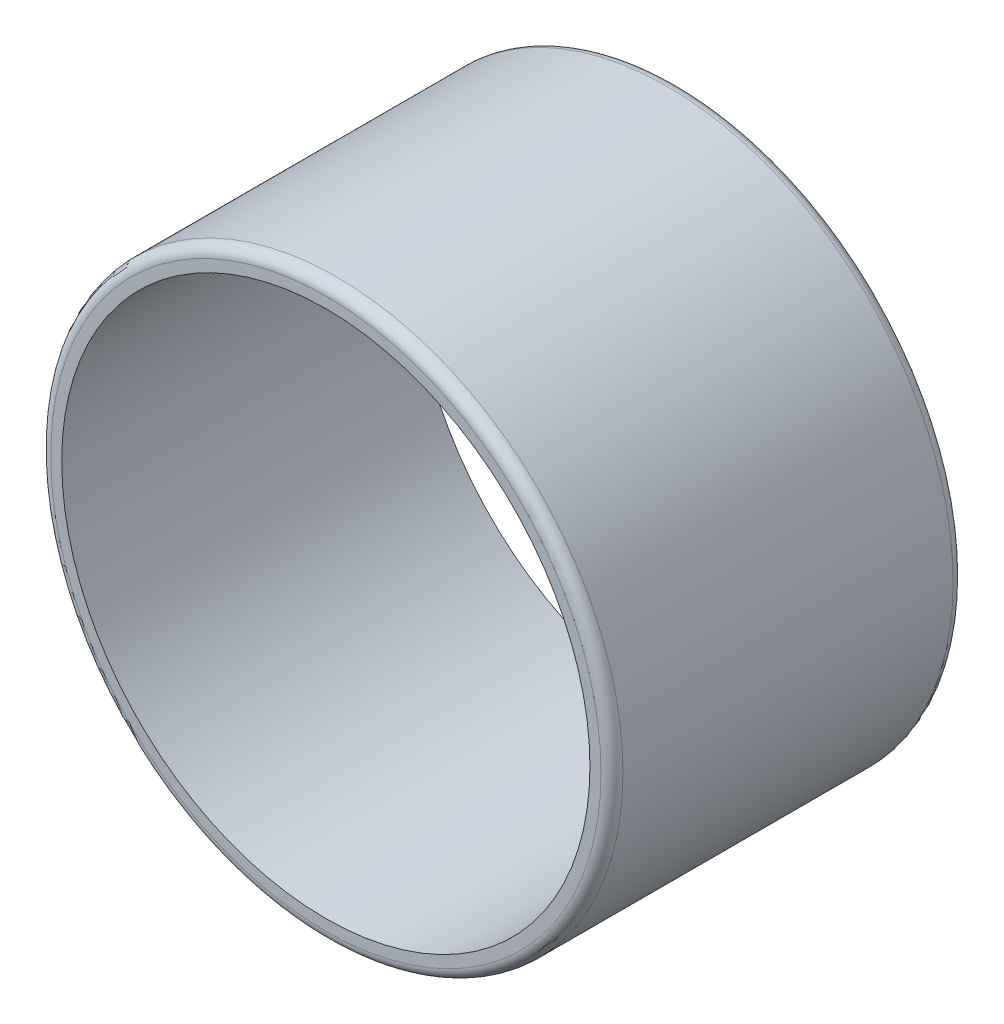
ISO-10303-21;
HEADER;
FILE_DESCRIPTION(('STEP AP214'),'2;1');
FILE_NAME('part.step','',(''),(''),'','','');
FILE_SCHEMA(('AUTOMOTIVE_DESIGN { 1 0 10303 214 1 1 1 1 }'));
ENDSEC;
DATA;
#1=APPLICATION_CONTEXT('core data for automotive mechanical design processes');
#2=APPLICATION_PROTOCOL_DEFINITION('international standard','automotive_design',2000,#1);
#3=PRODUCT_CONTEXT('',#1,'mechanical');
#4=PRODUCT('Part','Part','',(#3));
#5=PRODUCT_RELATED_PRODUCT_CATEGORY('part','',(#4));
#6=PRODUCT_DEFINITION_FORMATION('','',#4);
#7=PRODUCT_DEFINITION_CONTEXT('part definition',#1,'design');
#8=PRODUCT_DEFINITION('design','',#6,#7);
#9=PRODUCT_DEFINITION_SHAPE('','',#8);
#10=(LENGTH_UNIT() NAMED_UNIT(*) SI_UNIT(.MILLI.,.METRE.));
#11=(NAMED_UNIT(*) PLANE_ANGLE_UNIT() SI_UNIT($,.RADIAN.));
#12=(NAMED_UNIT(*) SI_UNIT($,.STERADIAN.) SOLID_ANGLE_UNIT());
#13=UNCERTAINTY_MEASURE_WITH_UNIT(LENGTH_MEASURE(1.E-05),#10,'distance_accuracy_value','');
#14=(GEOMETRIC_REPRESENTATION_CONTEXT(3) GLOBAL_UNCERTAINTY_ASSIGNED_CONTEXT((#13)) GLOBAL_UNIT_ASSIGNED_CONTEXT((#10,
#11,#12)) REPRESENTATION_CONTEXT('',''));
#15=CARTESIAN_POINT('',(0.,0.,0.));
#16=DIRECTION('',(0.,0.,1.));
#17=DIRECTION('',(1.,0.,0.));
#18=AXIS2_PLACEMENT_3D('',#15,#16,#17);
#19=CARTESIAN_POINT('',(0.,0.,8.));
#20=DIRECTION('',(0.,0.,1.));
#21=DIRECTION('',(1.,0.,0.));
#22=AXIS2_PLACEMENT_3D('',#19,#20,#21);
#23=PLANE('',#22);
#24=CARTESIAN_POINT('',(0.,0.,8.));
#25=DIRECTION('',(0.,0.,1.));
#26=DIRECTION('',(1.,0.,0.));
#27=AXIS2_PLACEMENT_3D('',#24,#25,#26);
#28=CIRCLE('',#27,12.5);
#29=CARTESIAN_POINT('',(12.5,0.,8.));
#30=VERTEX_POINT('',#29);
#31=EDGE_CURVE('E10',#30,#30,#28,.T.);
#32=ORIENTED_EDGE('',*,*,#31,.T.);
#33=EDGE_LOOP('',(#32));
#34=FACE_BOUND('',#33,.T.);
#35=CARTESIAN_POINT('',(0.,0.,8.));
#36=DIRECTION('',(0.,0.,1.));
#37=DIRECTION('',(1.,0.,0.));
#38=AXIS2_PLACEMENT_3D('',#35,#36,#37);
#39=CIRCLE('',#38,12.);
#40=CARTESIAN_POINT('',(12.,0.,8.));
#41=VERTEX_POINT('',#40);
#42=EDGE_CURVE('E49',#41,#41,#39,.T.);
#43=ORIENTED_EDGE('',*,*,#42,.F.);
#44=EDGE_LOOP('',(#43));
#45=FACE_BOUND('',#44,.T.);
#46=ADVANCED_FACE('F29',(#34,#45),#23,.T.);
#47=CARTESIAN_POINT('',(0.,0.,-8.));
#48=DIRECTION('',(0.,0.,1.));
#49=DIRECTION('',(1.,0.,0.));
#50=AXIS2_PLACEMENT_3D('',#47,#48,#49);
#51=PLANE('',#50);
#52=CARTESIAN_POINT('',(0.,0.,-8.));
#53=DIRECTION('',(0.,0.,1.));
#54=DIRECTION('',(1.,0.,0.));
#55=AXIS2_PLACEMENT_3D('',#52,#53,#54);
#56=CIRCLE('',#55,12.5);
#57=CARTESIAN_POINT('',(12.5,0.,-8.));
#58=VERTEX_POINT('',#57);
#59=EDGE_CURVE('E36',#58,#58,#56,.F.);
#60=ORIENTED_EDGE('',*,*,#59,.T.);
#61=EDGE_LOOP('',(#60));
#62=FACE_BOUND('',#61,.T.);
#63=CARTESIAN_POINT('',(0.,0.,-8.));
#64=DIRECTION('',(0.,0.,1.));
#65=DIRECTION('',(1.,0.,0.));
#66=AXIS2_PLACEMENT_3D('',#63,#64,#65);
#67=CIRCLE('',#66,12.);
#68=CARTESIAN_POINT('',(12.,0.,-8.));
#69=VERTEX_POINT('',#68);
#70=EDGE_CURVE('E52',#69,#69,#67,.T.);
#71=ORIENTED_EDGE('',*,*,#70,.T.);
#72=EDGE_LOOP('',(#71));
#73=FACE_BOUND('',#72,.T.);
#74=ADVANCED_FACE('F56',(#62,#73),#51,.F.);
#75=CARTESIAN_POINT('',(0.,0.,8.));
#76=DIRECTION('',(0.,0.,-1.));
#77=DIRECTION('',(-1.,0.,0.));
#78=AXIS2_PLACEMENT_3D('',#75,#76,#77);
#79=CYLINDRICAL_SURFACE('',#78,13.);
#80=CARTESIAN_POINT('',(0.,0.,-7.5));
#81=DIRECTION('',(0.,0.,1.));
#82=DIRECTION('',(1.,0.,0.));
#83=AXIS2_PLACEMENT_3D('',#80,#81,#82);
#84=CIRCLE('',#83,13.);
#85=CARTESIAN_POINT('',(13.,0.,-7.5));
#86=VERTEX_POINT('',#85);
#87=EDGE_CURVE('E40',#86,#86,#84,.T.);
#88=ORIENTED_EDGE('',*,*,#87,.T.);
#89=EDGE_LOOP('',(#88));
#90=FACE_BOUND('',#89,.T.);
#91=CARTESIAN_POINT('',(0.,0.,7.5));
#92=DIRECTION('',(0.,0.,1.));
#93=DIRECTION('',(1.,0.,0.));
#94=AXIS2_PLACEMENT_3D('',#91,#92,#93);
#95=CIRCLE('',#94,13.);
#96=CARTESIAN_POINT('',(13.,0.,7.5));
#97=VERTEX_POINT('',#96);
#98=EDGE_CURVE('E44',#97,#97,#95,.F.);
#99=ORIENTED_EDGE('',*,*,#98,.T.);
#100=EDGE_LOOP('',(#99));
#101=FACE_BOUND('',#100,.T.);
#102=ADVANCED_FACE('F31',(#90,#101),#79,.T.);
#103=CARTESIAN_POINT('',(0.,0.,8.));
#104=DIRECTION('',(0.,0.,-1.));
#105=DIRECTION('',(-1.,0.,0.));
#106=AXIS2_PLACEMENT_3D('',#103,#104,#105);
#107=CYLINDRICAL_SURFACE('',#106,12.);
#108=ORIENTED_EDGE('',*,*,#42,.T.);
#109=EDGE_LOOP('',(#108));
#110=FACE_BOUND('',#109,.T.);
#111=ORIENTED_EDGE('',*,*,#70,.F.);
#112=EDGE_LOOP('',(#111));
#113=FACE_BOUND('',#112,.T.);
#114=ADVANCED_FACE('F58',(#110,#113),#107,.F.);
#115=CARTESIAN_POINT('',(0.,0.,-7.5));
#116=DIRECTION('',(0.,0.,1.));
#117=DIRECTION('',(1.,0.,0.));
#118=AXIS2_PLACEMENT_3D('',#115,#116,#117);
#119=TOROIDAL_SURFACE('',#118,12.5,0.5);
#120=ORIENTED_EDGE('',*,*,#59,.F.);
#121=EDGE_LOOP('',(#120));
#122=FACE_BOUND('',#121,.T.);
#123=ORIENTED_EDGE('',*,*,#87,.F.);
#124=EDGE_LOOP('',(#123));
#125=FACE_BOUND('',#124,.T.);
#126=ADVANCED_FACE('F60',(#122,#125),#119,.T.);
#127=CARTESIAN_POINT('',(0.,0.,7.5));
#128=DIRECTION('',(0.,0.,1.));
#129=DIRECTION('',(1.,0.,0.));
#130=AXIS2_PLACEMENT_3D('',#127,#128,#129);
#131=TOROIDAL_SURFACE('',#130,12.5,0.5);
#132=ORIENTED_EDGE('',*,*,#98,.F.);
#133=EDGE_LOOP('',(#132));
#134=FACE_BOUND('',#133,.T.);
#135=ORIENTED_EDGE('',*,*,#31,.F.);
#136=EDGE_LOOP('',(#135));
#137=FACE_BOUND('',#136,.T.);
#138=ADVANCED_FACE('F67',(#134,#137),#131,.T.);
#139=CLOSED_SHELL('',(#46,#74,#102,#114,#126,#138));
#140=MANIFOLD_SOLID_BREP('B2',#139);
#141=ADVANCED_BREP_SHAPE_REPRESENTATION('',(#18,#140),#14);
#142=SHAPE_DEFINITION_REPRESENTATION(#9,#141);
ENDSEC;
END-ISO-10303-21;
